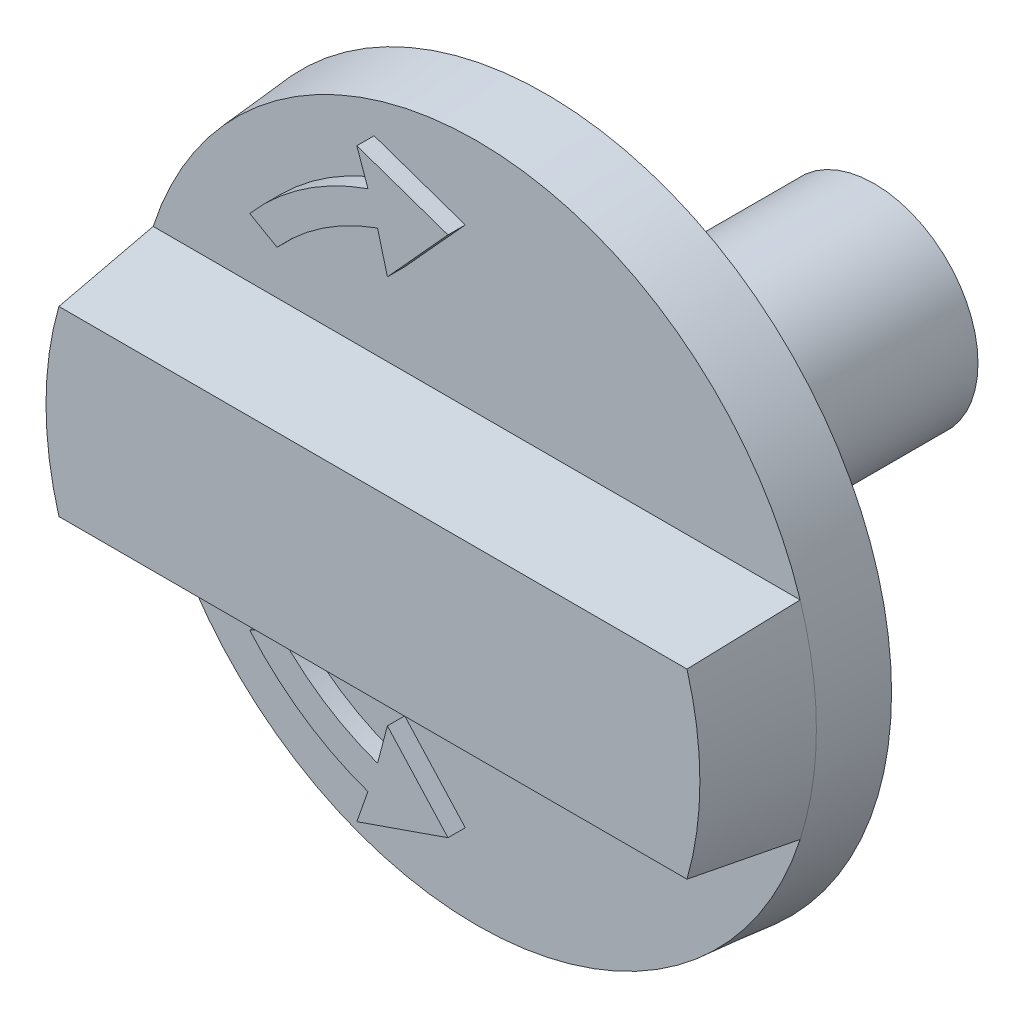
from build123d import *

# Parameters (mm, degrees)
ESQUISSE1_R                         = 10
BASE_EXTRUSION_DEPTH                = 2
BASE_EXTRUSION_TAPER                = 5
BOSS_EXTRU_1_DEPTH                  = 3
BOSS_EXTRU_1_TAPER                  = 7
BOSS_EXTRU_2_DEPTH                  = 0.5
ESQUISSE4_R                         = 3
BOSS_EXTRU_3_DEPTH                  = 9.5
ENL_V_MAT_EXTRU_1_REACH             = 19.037
ESQUISSE5_R                         = 1.5
ENL_V_MAT_EXTRU_1_DIRECTION_2_DEPTH = 2.4


with BuildPart() as part:
    # Esquisse1 → Base-Extrusion (new body)
    with BuildSketch(Plane.XY):
        Circle(ESQUISSE1_R)
    extrude(amount=BASE_EXTRUSION_DEPTH, taper=BASE_EXTRUSION_TAPER)

    # Esquisse2 → Boss.-Extru.1 (add)
    with BuildSketch(Plane.XY.offset(2)):
        with BuildLine():
            ThreePointArc((-9.355804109, 3), (-9.825022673, 0), (-9.355804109, -3))
            Line((-9.355804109, -3), (9.355804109, -3))
            ThreePointArc((9.355804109, -3), (9.825022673, 0), (9.355804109, 3))
            Line((9.355804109, 3), (-9.355804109, 3))
        make_face()
    extrude(amount=BOSS_EXTRU_1_DEPTH, taper=BOSS_EXTRU_1_TAPER)

    # Esquisse3 → Boss.-Extru.2 (add)
    with BuildSketch(Plane.XY.offset(2)):
        with BuildLine():
            Line((-6.062401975, 5.219892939), (-5.272979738, 4.767085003))
            ThreePointArc((-5.272979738, 4.767085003), (-3.940625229, 5.916154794), (-2.366860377, 6.702789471))
            Line((-2.366860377, 6.702789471), (-2.081951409, 5.623214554))
            Line((-2.081951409, 5.623214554), (-0.330777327, 7.549963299))
            Line((-0.330777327, 7.549963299), (-2.966269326, 8.46577596))
            Line((-2.966269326, 8.46577596), (-2.64538356, 7.549963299))
            ThreePointArc((-2.64538356, 7.549963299), (-4.507071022, 6.609562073), (-6.062401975, 5.219892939))
        make_face()
    boss_extru_2 = extrude(amount=BOSS_EXTRU_2_DEPTH)

    # Sym_trie1: Boss.-Extru.2 across plane
    add(boss_extru_2.mirror(Plane.ZX))

    # Esquisse4 → Boss.-Extru.3 (add)
    with BuildSketch(Plane(origin=(0, 0, 0), x_dir=(-1, 0, 0), z_dir=(0, 0, -1))):
        with Locations(Location((0, 0, 0), (0, 0, 180))):
            Circle(ESQUISSE4_R)
    extrude(amount=BOSS_EXTRU_3_DEPTH)

    # Esquisse5 → Enl_v. mat.-Extru.1 (cut, up to next)
    with BuildSketch(Plane(origin=(0, 0, 0), x_dir=(1, 0, 0), z_dir=(0, 1, 0)), mode=Mode.PRIVATE) as enl_v_mat_extru_1_sk1:
        with Locations(Location((0, 6, 0), (0, 0, 270))):
            Circle(ESQUISSE5_R)
    enl_v_mat_extru_1_tool1 = extrude(enl_v_mat_extru_1_sk1.sketch, amount=-ENL_V_MAT_EXTRU_1_REACH, mode=Mode.PRIVATE) & part.part
    add(enl_v_mat_extru_1_tool1.solids().sort_by_distance((0, 0, -6))[0], mode=Mode.SUBTRACT)

    # Esquisse5 → Enl_v. mat.-Extru.1 direction 2 (cut)
    with BuildSketch(Plane(origin=(0, 0, 0), x_dir=(1, 0, 0), z_dir=(0, 1, 0))):
        with Locations(Location((0, 6, 0), (0, 0, 270))):
            Circle(ESQUISSE5_R)
    extrude(amount=ENL_V_MAT_EXTRU_1_DIRECTION_2_DEPTH, mode=Mode.SUBTRACT)


solid = part.part
